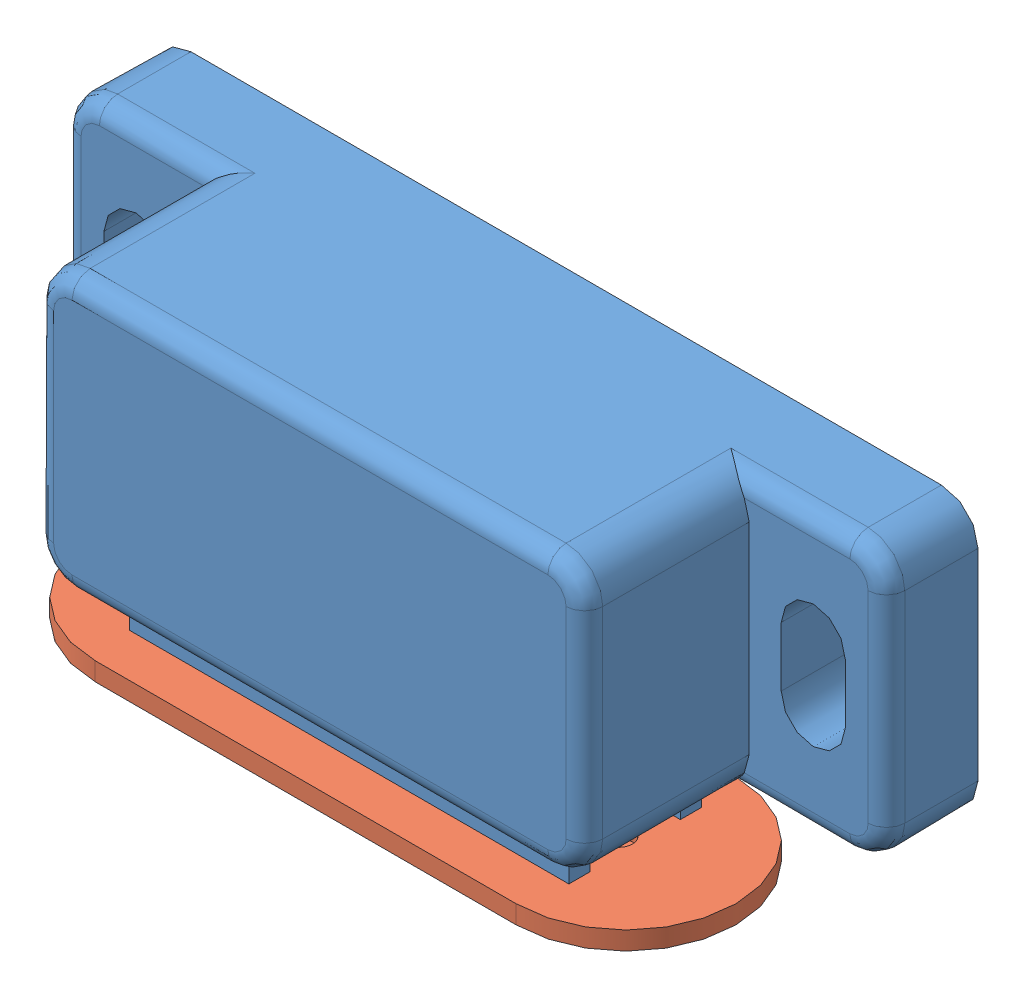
SolidWorks assembly 21.1753 MAGNETIC CATCH.SLDASM, configuration Default (file format 3800). Lengths in mm.
Overall size (45 18.85 14.22).
2 component instances, 2 part files, 3 mates.
Components (placement in the parent):
- 21.1753 MAGNETIC CATCH BODY-1: 21.1753 MAGNETIC CATCH BODY.SLDPRT [Default] at origin size (45 17.2 14)
- 21.1753 MAGNETIC CATCH HOLDING PLATE-1: 21.1753 MAGNETIC CATCH HOLDING PLATE.SLDPRT [Default] at (0 -10.7 8.225) x (1 0 0) z (0 1 0) size (35 12 1.65)
Mates (geometry in assembly coordinates):
- Coincident1: coincident anti-aligned: plane of 21.1753 MAGNETIC CATCH BODY-1 through (0 -9.7 11.27) normal (0 -1 0); plane of ? through (0 -9.7 8.7131) normal (0 1 0)
- Coincident2: coincident aligned: unknown of ?
- Distance1: distance = 2.375 mm aligned: plane of 21.1753 MAGNETIC CATCH HOLDING PLATE-1 through (11.5 -10.7 14.225) normal (0 0 1); plane of 21.1753 MAGNETIC CATCH BODY-1 through (-12 -7.5 11.85) normal (0 0 1)
